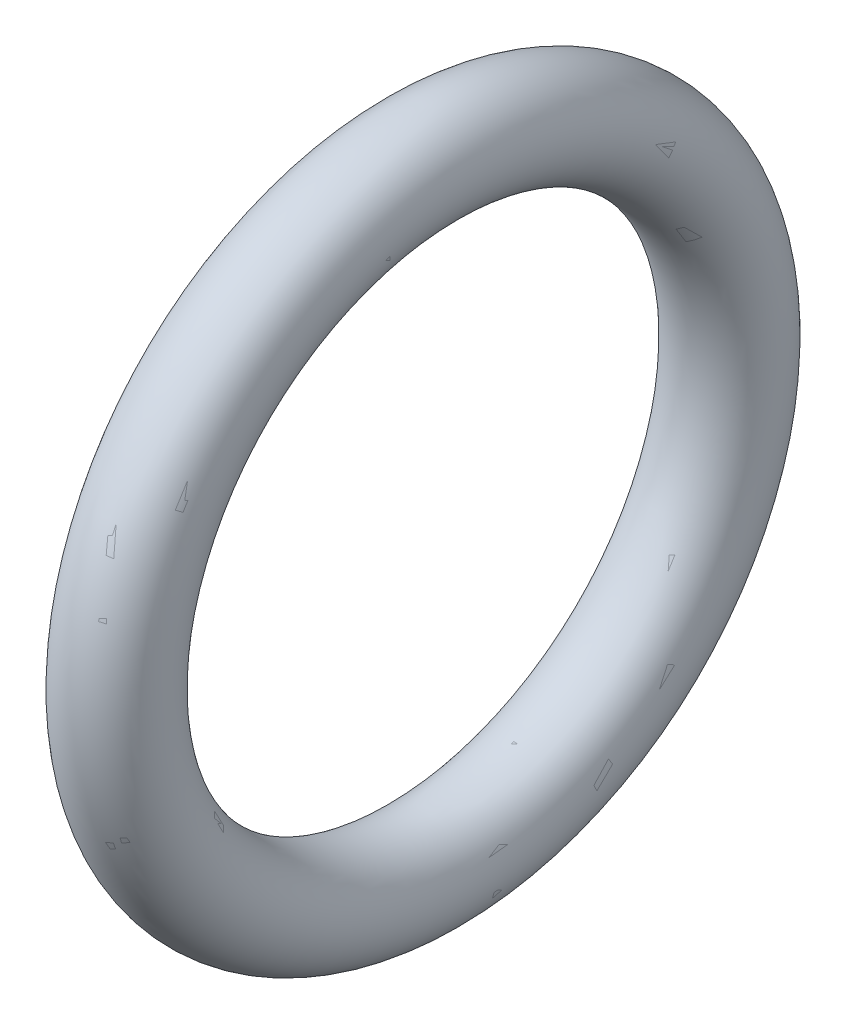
ISO-10303-21;
HEADER;
FILE_DESCRIPTION(('STEP AP214'),'2;1');
FILE_NAME('part.step','',(''),(''),'','','');
FILE_SCHEMA(('AUTOMOTIVE_DESIGN { 1 0 10303 214 1 1 1 1 }'));
ENDSEC;
DATA;
#1=APPLICATION_CONTEXT('core data for automotive mechanical design processes');
#2=APPLICATION_PROTOCOL_DEFINITION('international standard','automotive_design',2000,#1);
#3=PRODUCT_CONTEXT('',#1,'mechanical');
#4=PRODUCT('Part','Part','',(#3));
#5=PRODUCT_RELATED_PRODUCT_CATEGORY('part','',(#4));
#6=PRODUCT_DEFINITION_FORMATION('','',#4);
#7=PRODUCT_DEFINITION_CONTEXT('part definition',#1,'design');
#8=PRODUCT_DEFINITION('design','',#6,#7);
#9=PRODUCT_DEFINITION_SHAPE('','',#8);
#10=(LENGTH_UNIT() NAMED_UNIT(*) SI_UNIT(.MILLI.,.METRE.));
#11=(NAMED_UNIT(*) PLANE_ANGLE_UNIT() SI_UNIT($,.RADIAN.));
#12=(NAMED_UNIT(*) SI_UNIT($,.STERADIAN.) SOLID_ANGLE_UNIT());
#13=UNCERTAINTY_MEASURE_WITH_UNIT(LENGTH_MEASURE(1.E-05),#10,'distance_accuracy_value','');
#14=(GEOMETRIC_REPRESENTATION_CONTEXT(3) GLOBAL_UNCERTAINTY_ASSIGNED_CONTEXT((#13)) GLOBAL_UNIT_ASSIGNED_CONTEXT((#10,
#11,#12)) REPRESENTATION_CONTEXT('',''));
#15=CARTESIAN_POINT('',(0.,0.,0.));
#16=DIRECTION('',(0.,0.,1.));
#17=DIRECTION('',(1.,0.,0.));
#18=AXIS2_PLACEMENT_3D('',#15,#16,#17);
#19=CARTESIAN_POINT('',(7.,0.,0.));
#20=DIRECTION('',(1.,0.,0.));
#21=DIRECTION('',(0.,-1.,0.));
#22=AXIS2_PLACEMENT_3D('',#19,#20,#21);
#23=TOROIDAL_SURFACE('',#22,24.25,3.95);
#24=CARTESIAN_POINT('',(7.,-28.2,0.));
#25=VERTEX_POINT('',#24);
#26=VERTEX_LOOP('',#25);
#27=FACE_BOUND('',#26,.T.);
#28=ADVANCED_FACE('P0_F22',(#27),#23,.T.);
#29=CLOSED_SHELL('',(#28));
#30=MANIFOLD_SOLID_BREP('P0_B2',#29);
#31=CARTESIAN_POINT('',(7.,0.,0.));
#32=DIRECTION('',(1.,0.,0.));
#33=DIRECTION('',(0.,-1.,0.));
#34=AXIS2_PLACEMENT_3D('',#31,#32,#33);
#35=TOROIDAL_SURFACE('',#34,24.25,3.95);
#36=CARTESIAN_POINT('',(7.,-28.2,0.));
#37=VERTEX_POINT('',#36);
#38=VERTEX_LOOP('',#37);
#39=FACE_BOUND('',#38,.T.);
#40=ADVANCED_FACE('P1_F12',(#39),#35,.T.);
#41=CLOSED_SHELL('',(#40));
#42=MANIFOLD_SOLID_BREP('P1_B1',#41);
#43=ADVANCED_BREP_SHAPE_REPRESENTATION('',(#18,#30,#42),#14);
#44=SHAPE_DEFINITION_REPRESENTATION(#9,#43);
ENDSEC;
END-ISO-10303-21;
